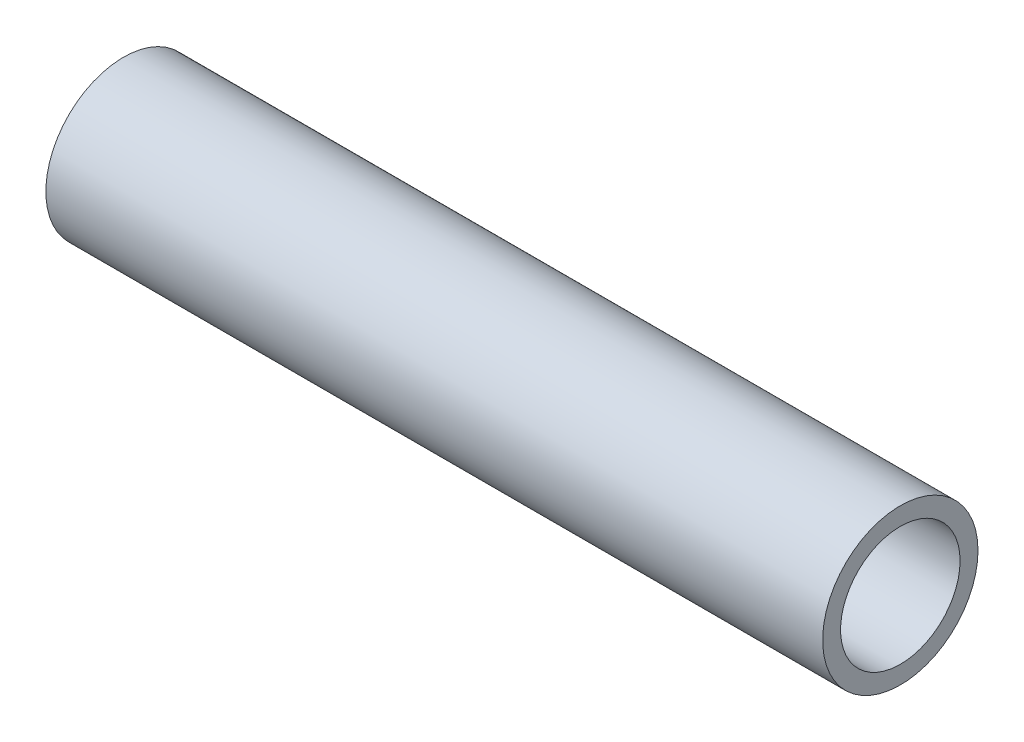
ISO-10303-21;
HEADER;
FILE_DESCRIPTION(('STEP AP214'),'2;1');
FILE_NAME('part.step','',(''),(''),'','','');
FILE_SCHEMA(('AUTOMOTIVE_DESIGN { 1 0 10303 214 1 1 1 1 }'));
ENDSEC;
DATA;
#1=APPLICATION_CONTEXT('core data for automotive mechanical design processes');
#2=APPLICATION_PROTOCOL_DEFINITION('international standard','automotive_design',2000,#1);
#3=PRODUCT_CONTEXT('',#1,'mechanical');
#4=PRODUCT('Part','Part','',(#3));
#5=PRODUCT_RELATED_PRODUCT_CATEGORY('part','',(#4));
#6=PRODUCT_DEFINITION_FORMATION('','',#4);
#7=PRODUCT_DEFINITION_CONTEXT('part definition',#1,'design');
#8=PRODUCT_DEFINITION('design','',#6,#7);
#9=PRODUCT_DEFINITION_SHAPE('','',#8);
#10=(LENGTH_UNIT() NAMED_UNIT(*) SI_UNIT(.MILLI.,.METRE.));
#11=(NAMED_UNIT(*) PLANE_ANGLE_UNIT() SI_UNIT($,.RADIAN.));
#12=(NAMED_UNIT(*) SI_UNIT($,.STERADIAN.) SOLID_ANGLE_UNIT());
#13=UNCERTAINTY_MEASURE_WITH_UNIT(LENGTH_MEASURE(1.E-05),#10,'distance_accuracy_value','');
#14=(GEOMETRIC_REPRESENTATION_CONTEXT(3) GLOBAL_UNCERTAINTY_ASSIGNED_CONTEXT((#13)) GLOBAL_UNIT_ASSIGNED_CONTEXT((#10,
#11,#12)) REPRESENTATION_CONTEXT('',''));
#15=CARTESIAN_POINT('',(0.,0.,0.));
#16=DIRECTION('',(0.,0.,1.));
#17=DIRECTION('',(1.,0.,0.));
#18=AXIS2_PLACEMENT_3D('',#15,#16,#17);
#19=CARTESIAN_POINT('',(165.1,0.,0.));
#20=DIRECTION('',(-1.,0.,0.));
#21=DIRECTION('',(0.,0.,1.));
#22=AXIS2_PLACEMENT_3D('',#19,#20,#21);
#23=CYLINDRICAL_SURFACE('',#22,12.7);
#24=CARTESIAN_POINT('',(165.1,0.,0.));
#25=DIRECTION('',(1.,0.,0.));
#26=DIRECTION('',(0.,0.,-1.));
#27=AXIS2_PLACEMENT_3D('',#24,#25,#26);
#28=CIRCLE('',#27,12.7);
#29=CARTESIAN_POINT('',(165.1,0.,-12.7));
#30=VERTEX_POINT('',#29);
#31=EDGE_CURVE('E53',#30,#30,#28,.T.);
#32=ORIENTED_EDGE('',*,*,#31,.T.);
#33=EDGE_LOOP('',(#32));
#34=FACE_BOUND('',#33,.T.);
#35=CARTESIAN_POINT('',(0.,0.,0.));
#36=DIRECTION('',(1.,0.,0.));
#37=DIRECTION('',(0.,0.,-1.));
#38=AXIS2_PLACEMENT_3D('',#35,#36,#37);
#39=CIRCLE('',#38,12.7);
#40=CARTESIAN_POINT('',(0.,0.,-12.7));
#41=VERTEX_POINT('',#40);
#42=EDGE_CURVE('E60',#41,#41,#39,.T.);
#43=ORIENTED_EDGE('',*,*,#42,.F.);
#44=EDGE_LOOP('',(#43));
#45=FACE_BOUND('',#44,.T.);
#46=ADVANCED_FACE('F45',(#34,#45),#23,.F.);
#47=CARTESIAN_POINT('',(165.1,0.,0.));
#48=DIRECTION('',(-1.,0.,0.));
#49=DIRECTION('',(0.,0.,1.));
#50=AXIS2_PLACEMENT_3D('',#47,#48,#49);
#51=CYLINDRICAL_SURFACE('',#50,16.51);
#52=CARTESIAN_POINT('',(165.1,0.,0.));
#53=DIRECTION('',(1.,0.,0.));
#54=DIRECTION('',(0.,0.,-1.));
#55=AXIS2_PLACEMENT_3D('',#52,#53,#54);
#56=CIRCLE('',#55,16.51);
#57=CARTESIAN_POINT('',(165.1,0.,-16.51));
#58=VERTEX_POINT('',#57);
#59=EDGE_CURVE('E10',#58,#58,#56,.T.);
#60=ORIENTED_EDGE('',*,*,#59,.F.);
#61=EDGE_LOOP('',(#60));
#62=FACE_BOUND('',#61,.T.);
#63=CARTESIAN_POINT('',(0.,0.,0.));
#64=DIRECTION('',(1.,0.,0.));
#65=DIRECTION('',(0.,0.,-1.));
#66=AXIS2_PLACEMENT_3D('',#63,#64,#65);
#67=CIRCLE('',#66,16.51);
#68=CARTESIAN_POINT('',(0.,0.,-16.51));
#69=VERTEX_POINT('',#68);
#70=EDGE_CURVE('E48',#69,#69,#67,.T.);
#71=ORIENTED_EDGE('',*,*,#70,.T.);
#72=EDGE_LOOP('',(#71));
#73=FACE_BOUND('',#72,.T.);
#74=ADVANCED_FACE('F69',(#62,#73),#51,.T.);
#75=CARTESIAN_POINT('',(165.1,0.,0.));
#76=DIRECTION('',(1.,0.,0.));
#77=DIRECTION('',(0.,0.,-1.));
#78=AXIS2_PLACEMENT_3D('',#75,#76,#77);
#79=PLANE('',#78);
#80=ORIENTED_EDGE('',*,*,#31,.F.);
#81=EDGE_LOOP('',(#80));
#82=FACE_BOUND('',#81,.T.);
#83=ORIENTED_EDGE('',*,*,#59,.T.);
#84=EDGE_LOOP('',(#83));
#85=FACE_BOUND('',#84,.T.);
#86=ADVANCED_FACE('F73',(#82,#85),#79,.T.);
#87=CARTESIAN_POINT('',(0.,0.,0.));
#88=DIRECTION('',(1.,0.,0.));
#89=DIRECTION('',(0.,0.,-1.));
#90=AXIS2_PLACEMENT_3D('',#87,#88,#89);
#91=PLANE('',#90);
#92=ORIENTED_EDGE('',*,*,#42,.T.);
#93=EDGE_LOOP('',(#92));
#94=FACE_BOUND('',#93,.T.);
#95=ORIENTED_EDGE('',*,*,#70,.F.);
#96=EDGE_LOOP('',(#95));
#97=FACE_BOUND('',#96,.T.);
#98=ADVANCED_FACE('F71',(#94,#97),#91,.F.);
#99=CLOSED_SHELL('',(#46,#74,#86,#98));
#100=MANIFOLD_SOLID_BREP('B2',#99);
#101=ADVANCED_BREP_SHAPE_REPRESENTATION('',(#18,#100),#14);
#102=SHAPE_DEFINITION_REPRESENTATION(#9,#101);
ENDSEC;
END-ISO-10303-21;
